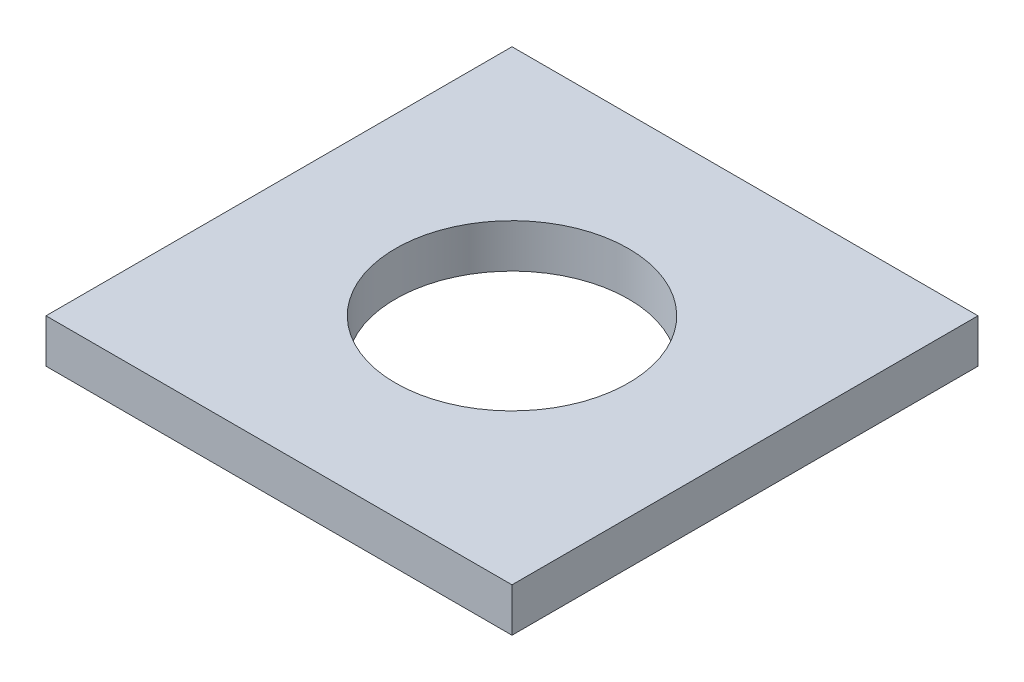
ISO-10303-21;
HEADER;
FILE_DESCRIPTION(('STEP AP214'),'2;1');
FILE_NAME('part.step','',(''),(''),'','','');
FILE_SCHEMA(('AUTOMOTIVE_DESIGN { 1 0 10303 214 1 1 1 1 }'));
ENDSEC;
DATA;
#1=APPLICATION_CONTEXT('core data for automotive mechanical design processes');
#2=APPLICATION_PROTOCOL_DEFINITION('international standard','automotive_design',2000,#1);
#3=PRODUCT_CONTEXT('',#1,'mechanical');
#4=PRODUCT('Part','Part','',(#3));
#5=PRODUCT_RELATED_PRODUCT_CATEGORY('part','',(#4));
#6=PRODUCT_DEFINITION_FORMATION('','',#4);
#7=PRODUCT_DEFINITION_CONTEXT('part definition',#1,'design');
#8=PRODUCT_DEFINITION('design','',#6,#7);
#9=PRODUCT_DEFINITION_SHAPE('','',#8);
#10=(LENGTH_UNIT() NAMED_UNIT(*) SI_UNIT(.MILLI.,.METRE.));
#11=(NAMED_UNIT(*) PLANE_ANGLE_UNIT() SI_UNIT($,.RADIAN.));
#12=(NAMED_UNIT(*) SI_UNIT($,.STERADIAN.) SOLID_ANGLE_UNIT());
#13=UNCERTAINTY_MEASURE_WITH_UNIT(LENGTH_MEASURE(1.E-05),#10,'distance_accuracy_value','');
#14=(GEOMETRIC_REPRESENTATION_CONTEXT(3) GLOBAL_UNCERTAINTY_ASSIGNED_CONTEXT((#13)) GLOBAL_UNIT_ASSIGNED_CONTEXT((#10,
#11,#12)) REPRESENTATION_CONTEXT('',''));
#15=CARTESIAN_POINT('',(0.,0.,0.));
#16=DIRECTION('',(0.,0.,1.));
#17=DIRECTION('',(1.,0.,0.));
#18=AXIS2_PLACEMENT_3D('',#15,#16,#17);
#19=CARTESIAN_POINT('',(-25.4,0.,25.4));
#20=DIRECTION('',(0.,0.,1.));
#21=DIRECTION('',(1.,0.,0.));
#22=AXIS2_PLACEMENT_3D('',#19,#20,#21);
#23=PLANE('',#22);
#24=DIRECTION('',(1.,0.,0.));
#25=VECTOR('',#24,1.);
#26=CARTESIAN_POINT('',(-25.4,4.7625,25.4));
#27=LINE('',#26,#25);
#28=CARTESIAN_POINT('',(-25.4,4.7625,25.4));
#29=VERTEX_POINT('',#28);
#30=CARTESIAN_POINT('',(25.4,4.7625,25.4));
#31=VERTEX_POINT('',#30);
#32=EDGE_CURVE('E96',#29,#31,#27,.T.);
#33=ORIENTED_EDGE('',*,*,#32,.F.);
#34=DIRECTION('',(0.,1.,0.));
#35=VECTOR('',#34,1.);
#36=CARTESIAN_POINT('',(-25.4,0.,25.4));
#37=LINE('',#36,#35);
#38=CARTESIAN_POINT('',(-25.4,0.,25.4));
#39=VERTEX_POINT('',#38);
#40=EDGE_CURVE('E11',#39,#29,#37,.T.);
#41=ORIENTED_EDGE('',*,*,#40,.F.);
#42=DIRECTION('',(1.,0.,0.));
#43=VECTOR('',#42,1.);
#44=CARTESIAN_POINT('',(-25.4,0.,25.4));
#45=LINE('',#44,#43);
#46=CARTESIAN_POINT('',(25.4,0.,25.4));
#47=VERTEX_POINT('',#46);
#48=EDGE_CURVE('E89',#39,#47,#45,.T.);
#49=ORIENTED_EDGE('',*,*,#48,.T.);
#50=DIRECTION('',(0.,1.,0.));
#51=VECTOR('',#50,1.);
#52=CARTESIAN_POINT('',(25.4,0.,25.4));
#53=LINE('',#52,#51);
#54=EDGE_CURVE('E34',#47,#31,#53,.T.);
#55=ORIENTED_EDGE('',*,*,#54,.T.);
#56=EDGE_LOOP('',(#33,#41,#49,#55));
#57=FACE_BOUND('',#56,.T.);
#58=ADVANCED_FACE('F31',(#57),#23,.T.);
#59=CARTESIAN_POINT('',(-25.4,0.,-25.4));
#60=DIRECTION('',(-1.,0.,0.));
#61=DIRECTION('',(0.,0.,1.));
#62=AXIS2_PLACEMENT_3D('',#59,#60,#61);
#63=PLANE('',#62);
#64=DIRECTION('',(0.,0.,1.));
#65=VECTOR('',#64,1.);
#66=CARTESIAN_POINT('',(-25.4,4.7625,-25.4));
#67=LINE('',#66,#65);
#68=CARTESIAN_POINT('',(-25.4,4.7625,-25.4));
#69=VERTEX_POINT('',#68);
#70=EDGE_CURVE('E91',#69,#29,#67,.T.);
#71=ORIENTED_EDGE('',*,*,#70,.F.);
#72=DIRECTION('',(0.,1.,0.));
#73=VECTOR('',#72,1.);
#74=CARTESIAN_POINT('',(-25.4,0.,-25.4));
#75=LINE('',#74,#73);
#76=CARTESIAN_POINT('',(-25.4,0.,-25.4));
#77=VERTEX_POINT('',#76);
#78=EDGE_CURVE('E40',#77,#69,#75,.T.);
#79=ORIENTED_EDGE('',*,*,#78,.F.);
#80=DIRECTION('',(0.,0.,1.));
#81=VECTOR('',#80,1.);
#82=CARTESIAN_POINT('',(-25.4,0.,-25.4));
#83=LINE('',#82,#81);
#84=EDGE_CURVE('E86',#77,#39,#83,.T.);
#85=ORIENTED_EDGE('',*,*,#84,.T.);
#86=ORIENTED_EDGE('',*,*,#40,.T.);
#87=EDGE_LOOP('',(#71,#79,#85,#86));
#88=FACE_BOUND('',#87,.T.);
#89=ADVANCED_FACE('F107',(#88),#63,.T.);
#90=CARTESIAN_POINT('',(25.4,0.,-25.4));
#91=DIRECTION('',(0.,0.,-1.));
#92=DIRECTION('',(-1.,0.,0.));
#93=AXIS2_PLACEMENT_3D('',#90,#91,#92);
#94=PLANE('',#93);
#95=DIRECTION('',(-1.,0.,0.));
#96=VECTOR('',#95,1.);
#97=CARTESIAN_POINT('',(25.4,4.7625,-25.4));
#98=LINE('',#97,#96);
#99=CARTESIAN_POINT('',(25.4,4.7625,-25.4));
#100=VERTEX_POINT('',#99);
#101=EDGE_CURVE('E81',#100,#69,#98,.T.);
#102=ORIENTED_EDGE('',*,*,#101,.F.);
#103=DIRECTION('',(0.,1.,0.));
#104=VECTOR('',#103,1.);
#105=CARTESIAN_POINT('',(25.4,0.,-25.4));
#106=LINE('',#105,#104);
#107=CARTESIAN_POINT('',(25.4,0.,-25.4));
#108=VERTEX_POINT('',#107);
#109=EDGE_CURVE('E76',#108,#100,#106,.T.);
#110=ORIENTED_EDGE('',*,*,#109,.F.);
#111=DIRECTION('',(-1.,0.,0.));
#112=VECTOR('',#111,1.);
#113=CARTESIAN_POINT('',(25.4,0.,-25.4));
#114=LINE('',#113,#112);
#115=EDGE_CURVE('E79',#108,#77,#114,.T.);
#116=ORIENTED_EDGE('',*,*,#115,.T.);
#117=ORIENTED_EDGE('',*,*,#78,.T.);
#118=EDGE_LOOP('',(#102,#110,#116,#117));
#119=FACE_BOUND('',#118,.T.);
#120=ADVANCED_FACE('F78',(#119),#94,.T.);
#121=CARTESIAN_POINT('',(25.4,0.,25.4));
#122=DIRECTION('',(1.,0.,0.));
#123=DIRECTION('',(0.,0.,-1.));
#124=AXIS2_PLACEMENT_3D('',#121,#122,#123);
#125=PLANE('',#124);
#126=DIRECTION('',(0.,0.,-1.));
#127=VECTOR('',#126,1.);
#128=CARTESIAN_POINT('',(25.4,4.7625,25.4));
#129=LINE('',#128,#127);
#130=EDGE_CURVE('E99',#31,#100,#129,.T.);
#131=ORIENTED_EDGE('',*,*,#130,.F.);
#132=ORIENTED_EDGE('',*,*,#54,.F.);
#133=DIRECTION('',(0.,0.,-1.));
#134=VECTOR('',#133,1.);
#135=CARTESIAN_POINT('',(25.4,0.,25.4));
#136=LINE('',#135,#134);
#137=EDGE_CURVE('E85',#47,#108,#136,.T.);
#138=ORIENTED_EDGE('',*,*,#137,.T.);
#139=ORIENTED_EDGE('',*,*,#109,.T.);
#140=EDGE_LOOP('',(#131,#132,#138,#139));
#141=FACE_BOUND('',#140,.T.);
#142=ADVANCED_FACE('F88',(#141),#125,.T.);
#143=CARTESIAN_POINT('',(25.4,0.,25.4));
#144=DIRECTION('',(0.,1.,0.));
#145=DIRECTION('',(0.,0.,1.));
#146=AXIS2_PLACEMENT_3D('',#143,#144,#145);
#147=PLANE('',#146);
#148=CARTESIAN_POINT('',(0.,0.,0.));
#149=DIRECTION('',(0.,1.,0.));
#150=DIRECTION('',(0.,0.,-1.));
#151=AXIS2_PLACEMENT_3D('',#148,#149,#150);
#152=CIRCLE('',#151,12.7);
#153=CARTESIAN_POINT('',(0.,0.,12.7));
#154=VERTEX_POINT('',#153);
#155=EDGE_CURVE('E100',#154,#154,#152,.T.);
#156=ORIENTED_EDGE('',*,*,#155,.T.);
#157=EDGE_LOOP('',(#156));
#158=FACE_BOUND('',#157,.T.);
#159=ORIENTED_EDGE('',*,*,#48,.F.);
#160=ORIENTED_EDGE('',*,*,#84,.F.);
#161=ORIENTED_EDGE('',*,*,#115,.F.);
#162=ORIENTED_EDGE('',*,*,#137,.F.);
#163=EDGE_LOOP('',(#159,#160,#161,#162));
#164=FACE_BOUND('',#163,.T.);
#165=ADVANCED_FACE('F84',(#158,#164),#147,.F.);
#166=CARTESIAN_POINT('',(25.4,4.7625,25.4));
#167=DIRECTION('',(0.,1.,0.));
#168=DIRECTION('',(0.,0.,1.));
#169=AXIS2_PLACEMENT_3D('',#166,#167,#168);
#170=PLANE('',#169);
#171=CARTESIAN_POINT('',(0.,4.7625,0.));
#172=DIRECTION('',(0.,1.,0.));
#173=DIRECTION('',(0.,0.,-1.));
#174=AXIS2_PLACEMENT_3D('',#171,#172,#173);
#175=CIRCLE('',#174,12.7);
#176=CARTESIAN_POINT('',(0.,4.7625,12.7));
#177=VERTEX_POINT('',#176);
#178=EDGE_CURVE('E137',#177,#177,#175,.T.);
#179=ORIENTED_EDGE('',*,*,#178,.F.);
#180=EDGE_LOOP('',(#179));
#181=FACE_BOUND('',#180,.T.);
#182=ORIENTED_EDGE('',*,*,#32,.T.);
#183=ORIENTED_EDGE('',*,*,#130,.T.);
#184=ORIENTED_EDGE('',*,*,#101,.T.);
#185=ORIENTED_EDGE('',*,*,#70,.T.);
#186=EDGE_LOOP('',(#182,#183,#184,#185));
#187=FACE_BOUND('',#186,.T.);
#188=ADVANCED_FACE('F106',(#181,#187),#170,.T.);
#189=CARTESIAN_POINT('',(0.,0.,0.));
#190=DIRECTION('',(0.,1.,0.));
#191=DIRECTION('',(0.,0.,1.));
#192=AXIS2_PLACEMENT_3D('',#189,#190,#191);
#193=CYLINDRICAL_SURFACE('',#192,12.7);
#194=CARTESIAN_POINT('',(0.,0.,12.7));
#195=CARTESIAN_POINT('',(0.,0.049609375,12.7));
#196=CARTESIAN_POINT('',(0.,0.09921875,12.7));
#197=CARTESIAN_POINT('',(0.,0.1984375,12.7));
#198=CARTESIAN_POINT('',(0.,0.248046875,12.7));
#199=CARTESIAN_POINT('',(0.,0.347265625,12.7));
#200=CARTESIAN_POINT('',(0.,0.396875,12.7));
#201=CARTESIAN_POINT('',(0.,0.49609375,12.7));
#202=CARTESIAN_POINT('',(0.,0.545703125,12.7));
#203=CARTESIAN_POINT('',(0.,0.644921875,12.7));
#204=CARTESIAN_POINT('',(0.,0.69453125,12.7));
#205=CARTESIAN_POINT('',(0.,0.79375,12.7));
#206=CARTESIAN_POINT('',(0.,0.843359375,12.7));
#207=CARTESIAN_POINT('',(0.,0.942578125,12.7));
#208=CARTESIAN_POINT('',(0.,0.9921875,12.7));
#209=CARTESIAN_POINT('',(0.,1.09140625,12.7));
#210=CARTESIAN_POINT('',(0.,1.141015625,12.7));
#211=CARTESIAN_POINT('',(0.,1.240234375,12.7));
#212=CARTESIAN_POINT('',(0.,1.28984375,12.7));
#213=CARTESIAN_POINT('',(0.,1.3890625,12.7));
#214=CARTESIAN_POINT('',(0.,1.438671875,12.7));
#215=CARTESIAN_POINT('',(0.,1.537890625,12.7));
#216=CARTESIAN_POINT('',(0.,1.5875,12.7));
#217=CARTESIAN_POINT('',(0.,1.68671875,12.7));
#218=CARTESIAN_POINT('',(0.,1.736328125,12.7));
#219=CARTESIAN_POINT('',(0.,1.835546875,12.7));
#220=CARTESIAN_POINT('',(0.,1.88515625,12.7));
#221=CARTESIAN_POINT('',(0.,1.984375,12.7));
#222=CARTESIAN_POINT('',(0.,2.033984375,12.7));
#223=CARTESIAN_POINT('',(0.,2.133203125,12.7));
#224=CARTESIAN_POINT('',(0.,2.1828125,12.7));
#225=CARTESIAN_POINT('',(0.,2.28203125,12.7));
#226=CARTESIAN_POINT('',(0.,2.331640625,12.7));
#227=CARTESIAN_POINT('',(0.,2.430859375,12.7));
#228=CARTESIAN_POINT('',(0.,2.48046875,12.7));
#229=CARTESIAN_POINT('',(0.,2.5796875,12.7));
#230=CARTESIAN_POINT('',(0.,2.629296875,12.7));
#231=CARTESIAN_POINT('',(0.,2.728515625,12.7));
#232=CARTESIAN_POINT('',(0.,2.778125,12.7));
#233=CARTESIAN_POINT('',(0.,2.87734375,12.7));
#234=CARTESIAN_POINT('',(0.,2.926953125,12.7));
#235=CARTESIAN_POINT('',(0.,3.026171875,12.7));
#236=CARTESIAN_POINT('',(0.,3.07578125,12.7));
#237=CARTESIAN_POINT('',(0.,3.175,12.7));
#238=CARTESIAN_POINT('',(0.,3.224609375,12.7));
#239=CARTESIAN_POINT('',(0.,3.323828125,12.7));
#240=CARTESIAN_POINT('',(0.,3.3734375,12.7));
#241=CARTESIAN_POINT('',(0.,3.47265625,12.7));
#242=CARTESIAN_POINT('',(0.,3.522265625,12.7));
#243=CARTESIAN_POINT('',(0.,3.621484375,12.7));
#244=CARTESIAN_POINT('',(0.,3.67109375,12.7));
#245=CARTESIAN_POINT('',(0.,3.7703125,12.7));
#246=CARTESIAN_POINT('',(0.,3.819921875,12.7));
#247=CARTESIAN_POINT('',(0.,3.919140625,12.7));
#248=CARTESIAN_POINT('',(0.,3.96875,12.7));
#249=CARTESIAN_POINT('',(0.,4.06796875,12.7));
#250=CARTESIAN_POINT('',(0.,4.117578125,12.7));
#251=CARTESIAN_POINT('',(0.,4.216796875,12.7));
#252=CARTESIAN_POINT('',(0.,4.26640625,12.7));
#253=CARTESIAN_POINT('',(0.,4.365625,12.7));
#254=CARTESIAN_POINT('',(0.,4.415234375,12.7));
#255=CARTESIAN_POINT('',(0.,4.514453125,12.7));
#256=CARTESIAN_POINT('',(0.,4.5640625,12.7));
#257=CARTESIAN_POINT('',(0.,4.66328125,12.7));
#258=CARTESIAN_POINT('',(0.,4.712890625,12.7));
#259=CARTESIAN_POINT('',(0.,4.7625,12.7));
#260=B_SPLINE_CURVE_WITH_KNOTS('',3,(#194,#195,#196,#197,#198,#199,#200,#201,#202,#203,#204,
#205,#206,#207,#208,#209,#210,#211,#212,#213,#214,#215,#216,#217,#218,#219,#220,#221,#222,#223,
#224,#225,#226,#227,#228,#229,#230,#231,#232,#233,#234,#235,#236,#237,#238,#239,#240,#241,#242,
#243,#244,#245,#246,#247,#248,#249,#250,#251,#252,#253,#254,#255,#256,#257,#258,#259),
.UNSPECIFIED.,.F.,.F.,(4,2,2,2,2,2,2,2,2,2,2,2,2,2,2,2,2,2,2,2,2,2,2,2,2,2,2,2,2,2,2,2,4),(0.,
0.148828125,0.29765625,0.446484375,0.5953125,0.744140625,0.89296875,1.041796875,1.190625,
1.339453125,1.48828125,1.637109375,1.7859375,1.934765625,2.08359375,2.232421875,2.38125,
2.530078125,2.67890625,2.827734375,2.9765625,3.125390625,3.27421875,3.423046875,3.571875,
3.720703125,3.86953125,4.018359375,4.1671875,4.316015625,4.46484375,4.613671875,4.7625),.UNSPECIFIED.);
#261=EDGE_CURVE('BSEAM125',#154,#177,#260,.T.);
#262=ORIENTED_EDGE('',*,*,#155,.F.);
#263=ORIENTED_EDGE('',*,*,#178,.T.);
#264=ORIENTED_EDGE('',*,*,#261,.T.);
#265=ORIENTED_EDGE('',*,*,#261,.F.);
#266=EDGE_LOOP('',(#262,#264,#263,#265));
#267=FACE_BOUND('',#266,.T.);
#268=ADVANCED_FACE('F125',(#267),#193,.F.);
#269=CLOSED_SHELL('',(#58,#89,#120,#142,#165,#188,#268));
#270=MANIFOLD_SOLID_BREP('B2',#269);
#271=ADVANCED_BREP_SHAPE_REPRESENTATION('',(#18,#270),#14);
#272=SHAPE_DEFINITION_REPRESENTATION(#9,#271);
ENDSEC;
END-ISO-10303-21;
